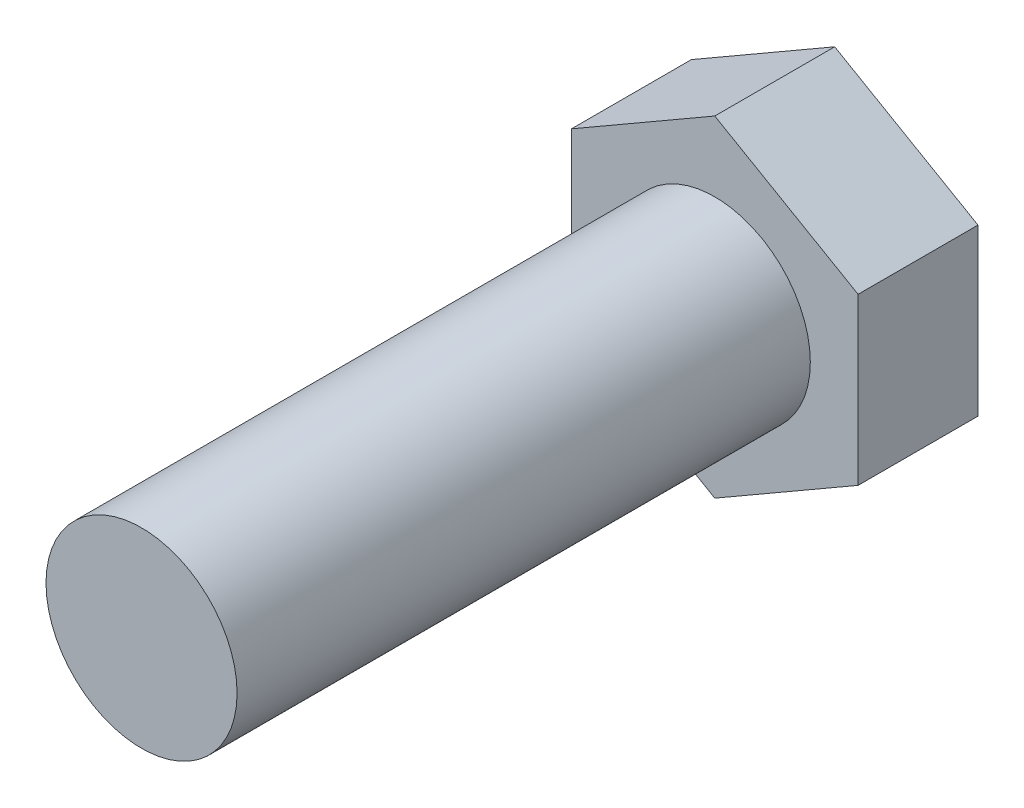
ISO-10303-21;
HEADER;
FILE_DESCRIPTION(('STEP AP214'),'2;1');
FILE_NAME('part.step','',(''),(''),'','','');
FILE_SCHEMA(('AUTOMOTIVE_DESIGN { 1 0 10303 214 1 1 1 1 }'));
ENDSEC;
DATA;
#1=APPLICATION_CONTEXT('core data for automotive mechanical design processes');
#2=APPLICATION_PROTOCOL_DEFINITION('international standard','automotive_design',2000,#1);
#3=PRODUCT_CONTEXT('',#1,'mechanical');
#4=PRODUCT('Part','Part','',(#3));
#5=PRODUCT_RELATED_PRODUCT_CATEGORY('part','',(#4));
#6=PRODUCT_DEFINITION_FORMATION('','',#4);
#7=PRODUCT_DEFINITION_CONTEXT('part definition',#1,'design');
#8=PRODUCT_DEFINITION('design','',#6,#7);
#9=PRODUCT_DEFINITION_SHAPE('','',#8);
#10=(LENGTH_UNIT() NAMED_UNIT(*) SI_UNIT(.MILLI.,.METRE.));
#11=(NAMED_UNIT(*) PLANE_ANGLE_UNIT() SI_UNIT($,.RADIAN.));
#12=(NAMED_UNIT(*) SI_UNIT($,.STERADIAN.) SOLID_ANGLE_UNIT());
#13=UNCERTAINTY_MEASURE_WITH_UNIT(LENGTH_MEASURE(1.E-05),#10,'distance_accuracy_value','');
#14=(GEOMETRIC_REPRESENTATION_CONTEXT(3) GLOBAL_UNCERTAINTY_ASSIGNED_CONTEXT((#13)) GLOBAL_UNIT_ASSIGNED_CONTEXT((#10,
#11,#12)) REPRESENTATION_CONTEXT('',''));
#15=CARTESIAN_POINT('',(0.,0.,0.));
#16=DIRECTION('',(0.,0.,1.));
#17=DIRECTION('',(1.,0.,0.));
#18=AXIS2_PLACEMENT_3D('',#15,#16,#17);
#19=CARTESIAN_POINT('',(0.,0.,73.7));
#20=DIRECTION('',(0.,0.,-1.));
#21=DIRECTION('',(-1.,0.,0.));
#22=AXIS2_PLACEMENT_3D('',#19,#20,#21);
#23=PLANE('',#22);
#24=CARTESIAN_POINT('',(0.,0.,73.7));
#25=DIRECTION('',(0.,0.,-1.));
#26=DIRECTION('',(-1.,0.,0.));
#27=AXIS2_PLACEMENT_3D('',#24,#25,#26);
#28=CIRCLE('',#27,10.);
#29=CARTESIAN_POINT('',(-10.,0.,73.7));
#30=VERTEX_POINT('',#29);
#31=EDGE_CURVE('E22',#30,#30,#28,.T.);
#32=ORIENTED_EDGE('',*,*,#31,.F.);
#33=EDGE_LOOP('',(#32));
#34=FACE_BOUND('',#33,.T.);
#35=ADVANCED_FACE('F15',(#34),#23,.F.);
#36=CARTESIAN_POINT('',(0.,0.,3.7));
#37=DIRECTION('',(0.,0.,-1.));
#38=DIRECTION('',(-1.,0.,0.));
#39=AXIS2_PLACEMENT_3D('',#36,#37,#38);
#40=CYLINDRICAL_SURFACE('',#39,10.);
#41=CARTESIAN_POINT('',(0.,0.,13.7));
#42=DIRECTION('',(0.,0.,-1.));
#43=DIRECTION('',(-1.,0.,0.));
#44=AXIS2_PLACEMENT_3D('',#41,#42,#43);
#45=CIRCLE('',#44,10.);
#46=CARTESIAN_POINT('',(-10.,0.,13.7));
#47=VERTEX_POINT('',#46);
#48=EDGE_CURVE('E110',#47,#47,#45,.T.);
#49=ORIENTED_EDGE('',*,*,#48,.F.);
#50=EDGE_LOOP('',(#49));
#51=FACE_BOUND('',#50,.T.);
#52=ORIENTED_EDGE('',*,*,#31,.T.);
#53=EDGE_LOOP('',(#52));
#54=FACE_BOUND('',#53,.T.);
#55=ADVANCED_FACE('F154',(#51,#54),#40,.T.);
#56=CARTESIAN_POINT('',(-10.,0.,13.7));
#57=DIRECTION('',(0.,0.,-1.));
#58=DIRECTION('',(-1.,0.,0.));
#59=AXIS2_PLACEMENT_3D('',#56,#57,#58);
#60=PLANE('',#59);
#61=DIRECTION('',(0.866025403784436,-0.5,0.));
#62=VECTOR('',#61,1.);
#63=CARTESIAN_POINT('',(1.14491749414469E-13,17.3205080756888,13.7));
#64=LINE('',#63,#62);
#65=CARTESIAN_POINT('',(0.,17.3205080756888,13.7));
#66=VERTEX_POINT('',#65);
#67=CARTESIAN_POINT('',(15.,8.66025403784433,13.7));
#68=VERTEX_POINT('',#67);
#69=EDGE_CURVE('E81',#66,#68,#64,.T.);
#70=ORIENTED_EDGE('',*,*,#69,.F.);
#71=DIRECTION('',(-0.866025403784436,-0.5,0.));
#72=VECTOR('',#71,1.);
#73=CARTESIAN_POINT('',(-15.,8.66025403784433,13.7));
#74=LINE('',#73,#72);
#75=CARTESIAN_POINT('',(-15.,8.66025403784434,13.7));
#76=VERTEX_POINT('',#75);
#77=EDGE_CURVE('E107',#66,#76,#74,.T.);
#78=ORIENTED_EDGE('',*,*,#77,.T.);
#79=DIRECTION('',(0.,-1.,0.));
#80=VECTOR('',#79,1.);
#81=CARTESIAN_POINT('',(-15.,0.,13.7));
#82=LINE('',#81,#80);
#83=CARTESIAN_POINT('',(-15.,-8.66025403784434,13.7));
#84=VERTEX_POINT('',#83);
#85=EDGE_CURVE('E104',#76,#84,#82,.T.);
#86=ORIENTED_EDGE('',*,*,#85,.T.);
#87=DIRECTION('',(-0.866025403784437,0.5,0.));
#88=VECTOR('',#87,1.);
#89=CARTESIAN_POINT('',(-15.,-8.66025403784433,13.7));
#90=LINE('',#89,#88);
#91=CARTESIAN_POINT('',(0.,-17.3205080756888,13.7));
#92=VERTEX_POINT('',#91);
#93=EDGE_CURVE('E102',#92,#84,#90,.T.);
#94=ORIENTED_EDGE('',*,*,#93,.F.);
#95=DIRECTION('',(0.866025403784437,0.5,0.));
#96=VECTOR('',#95,1.);
#97=CARTESIAN_POINT('',(0.,-17.3205080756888,13.7));
#98=LINE('',#97,#96);
#99=CARTESIAN_POINT('',(15.,-8.66025403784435,13.7));
#100=VERTEX_POINT('',#99);
#101=EDGE_CURVE('E99',#92,#100,#98,.T.);
#102=ORIENTED_EDGE('',*,*,#101,.T.);
#103=DIRECTION('',(0.,-1.,0.));
#104=VECTOR('',#103,1.);
#105=CARTESIAN_POINT('',(15.,0.,13.7));
#106=LINE('',#105,#104);
#107=EDGE_CURVE('E97',#68,#100,#106,.T.);
#108=ORIENTED_EDGE('',*,*,#107,.F.);
#109=EDGE_LOOP('',(#70,#78,#86,#94,#102,#108));
#110=FACE_BOUND('',#109,.T.);
#111=ORIENTED_EDGE('',*,*,#48,.T.);
#112=EDGE_LOOP('',(#111));
#113=FACE_BOUND('',#112,.T.);
#114=ADVANCED_FACE('F136',(#110,#113),#60,.F.);
#115=CARTESIAN_POINT('',(0.,17.3205080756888,15.));
#116=DIRECTION('',(0.5,-0.866025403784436,0.));
#117=DIRECTION('',(-0.866025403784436,-0.5,0.));
#118=AXIS2_PLACEMENT_3D('',#115,#116,#117);
#119=PLANE('',#118);
#120=DIRECTION('',(0.,0.,-1.));
#121=VECTOR('',#120,1.);
#122=CARTESIAN_POINT('',(0.,17.3205080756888,15.));
#123=LINE('',#122,#121);
#124=CARTESIAN_POINT('',(0.,17.3205080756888,1.15));
#125=VERTEX_POINT('',#124);
#126=EDGE_CURVE('E35',#66,#125,#123,.T.);
#127=ORIENTED_EDGE('',*,*,#126,.T.);
#128=DIRECTION('',(-0.866025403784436,-0.5,0.));
#129=VECTOR('',#128,1.);
#130=CARTESIAN_POINT('',(0.,17.3205080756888,1.15));
#131=LINE('',#130,#129);
#132=CARTESIAN_POINT('',(-15.,8.66025403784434,1.15));
#133=VERTEX_POINT('',#132);
#134=EDGE_CURVE('E28',#125,#133,#131,.T.);
#135=ORIENTED_EDGE('',*,*,#134,.T.);
#136=DIRECTION('',(0.,0.,-1.));
#137=VECTOR('',#136,1.);
#138=CARTESIAN_POINT('',(-15.,8.66025403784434,15.));
#139=LINE('',#138,#137);
#140=EDGE_CURVE('E93',#76,#133,#139,.T.);
#141=ORIENTED_EDGE('',*,*,#140,.F.);
#142=ORIENTED_EDGE('',*,*,#77,.F.);
#143=EDGE_LOOP('',(#127,#135,#141,#142));
#144=FACE_BOUND('',#143,.T.);
#145=ADVANCED_FACE('F130',(#144),#119,.F.);
#146=CARTESIAN_POINT('',(-15.,8.66025403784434,15.));
#147=DIRECTION('',(1.,0.,0.));
#148=DIRECTION('',(0.,-1.,0.));
#149=AXIS2_PLACEMENT_3D('',#146,#147,#148);
#150=PLANE('',#149);
#151=ORIENTED_EDGE('',*,*,#140,.T.);
#152=DIRECTION('',(0.,-1.,0.));
#153=VECTOR('',#152,1.);
#154=CARTESIAN_POINT('',(-15.,8.66025403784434,1.15));
#155=LINE('',#154,#153);
#156=CARTESIAN_POINT('',(-15.,-8.66025403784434,1.15));
#157=VERTEX_POINT('',#156);
#158=EDGE_CURVE('E126',#133,#157,#155,.T.);
#159=ORIENTED_EDGE('',*,*,#158,.T.);
#160=DIRECTION('',(0.,0.,-1.));
#161=VECTOR('',#160,1.);
#162=CARTESIAN_POINT('',(-15.,-8.66025403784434,15.));
#163=LINE('',#162,#161);
#164=EDGE_CURVE('E90',#84,#157,#163,.T.);
#165=ORIENTED_EDGE('',*,*,#164,.F.);
#166=ORIENTED_EDGE('',*,*,#85,.F.);
#167=EDGE_LOOP('',(#151,#159,#165,#166));
#168=FACE_BOUND('',#167,.T.);
#169=ADVANCED_FACE('F132',(#168),#150,.F.);
#170=CARTESIAN_POINT('',(0.,-17.3205080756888,15.));
#171=DIRECTION('',(-0.5,-0.866025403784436,0.));
#172=DIRECTION('',(-0.866025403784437,0.5,0.));
#173=AXIS2_PLACEMENT_3D('',#170,#171,#172);
#174=PLANE('',#173);
#175=DIRECTION('',(-0.866025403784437,0.5,0.));
#176=VECTOR('',#175,1.);
#177=CARTESIAN_POINT('',(0.,-17.3205080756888,1.15));
#178=LINE('',#177,#176);
#179=CARTESIAN_POINT('',(0.,-17.3205080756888,1.15));
#180=VERTEX_POINT('',#179);
#181=EDGE_CURVE('E124',#180,#157,#178,.T.);
#182=ORIENTED_EDGE('',*,*,#181,.F.);
#183=DIRECTION('',(0.,0.,-1.));
#184=VECTOR('',#183,1.);
#185=CARTESIAN_POINT('',(0.,-17.3205080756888,15.));
#186=LINE('',#185,#184);
#187=EDGE_CURVE('E83',#92,#180,#186,.T.);
#188=ORIENTED_EDGE('',*,*,#187,.F.);
#189=ORIENTED_EDGE('',*,*,#93,.T.);
#190=ORIENTED_EDGE('',*,*,#164,.T.);
#191=EDGE_LOOP('',(#182,#188,#189,#190));
#192=FACE_BOUND('',#191,.T.);
#193=ADVANCED_FACE('F143',(#192),#174,.T.);
#194=CARTESIAN_POINT('',(0.,-17.3205080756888,15.));
#195=DIRECTION('',(-0.5,0.866025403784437,0.));
#196=DIRECTION('',(0.866025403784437,0.5,0.));
#197=AXIS2_PLACEMENT_3D('',#194,#195,#196);
#198=PLANE('',#197);
#199=ORIENTED_EDGE('',*,*,#187,.T.);
#200=DIRECTION('',(0.866025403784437,0.5,0.));
#201=VECTOR('',#200,1.);
#202=CARTESIAN_POINT('',(0.,-17.3205080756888,1.15));
#203=LINE('',#202,#201);
#204=CARTESIAN_POINT('',(15.,-8.66025403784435,1.15));
#205=VERTEX_POINT('',#204);
#206=EDGE_CURVE('E76',#180,#205,#203,.T.);
#207=ORIENTED_EDGE('',*,*,#206,.T.);
#208=DIRECTION('',(0.,0.,-1.));
#209=VECTOR('',#208,1.);
#210=CARTESIAN_POINT('',(15.,-8.66025403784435,15.));
#211=LINE('',#210,#209);
#212=EDGE_CURVE('E75',#100,#205,#211,.T.);
#213=ORIENTED_EDGE('',*,*,#212,.F.);
#214=ORIENTED_EDGE('',*,*,#101,.F.);
#215=EDGE_LOOP('',(#199,#207,#213,#214));
#216=FACE_BOUND('',#215,.T.);
#217=ADVANCED_FACE('F139',(#216),#198,.F.);
#218=CARTESIAN_POINT('',(15.,8.66025403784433,15.));
#219=DIRECTION('',(1.,0.,0.));
#220=DIRECTION('',(0.,-1.,0.));
#221=AXIS2_PLACEMENT_3D('',#218,#219,#220);
#222=PLANE('',#221);
#223=DIRECTION('',(0.,-1.,0.));
#224=VECTOR('',#223,1.);
#225=CARTESIAN_POINT('',(15.,8.66025403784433,1.15));
#226=LINE('',#225,#224);
#227=CARTESIAN_POINT('',(15.,8.66025403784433,1.15));
#228=VERTEX_POINT('',#227);
#229=EDGE_CURVE('E65',#228,#205,#226,.T.);
#230=ORIENTED_EDGE('',*,*,#229,.F.);
#231=DIRECTION('',(0.,0.,-1.));
#232=VECTOR('',#231,1.);
#233=CARTESIAN_POINT('',(15.,8.66025403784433,15.));
#234=LINE('',#233,#232);
#235=EDGE_CURVE('E72',#68,#228,#234,.T.);
#236=ORIENTED_EDGE('',*,*,#235,.F.);
#237=ORIENTED_EDGE('',*,*,#107,.T.);
#238=ORIENTED_EDGE('',*,*,#212,.T.);
#239=EDGE_LOOP('',(#230,#236,#237,#238));
#240=FACE_BOUND('',#239,.T.);
#241=ADVANCED_FACE('F71',(#240),#222,.T.);
#242=CARTESIAN_POINT('',(0.,17.3205080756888,15.));
#243=DIRECTION('',(0.5,0.866025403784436,0.));
#244=DIRECTION('',(0.866025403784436,-0.5,0.));
#245=AXIS2_PLACEMENT_3D('',#242,#243,#244);
#246=PLANE('',#245);
#247=DIRECTION('',(0.866025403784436,-0.5,0.));
#248=VECTOR('',#247,1.);
#249=CARTESIAN_POINT('',(0.,17.3205080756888,1.15));
#250=LINE('',#249,#248);
#251=EDGE_CURVE('E9',#125,#228,#250,.T.);
#252=ORIENTED_EDGE('',*,*,#251,.F.);
#253=ORIENTED_EDGE('',*,*,#126,.F.);
#254=ORIENTED_EDGE('',*,*,#69,.T.);
#255=ORIENTED_EDGE('',*,*,#235,.T.);
#256=EDGE_LOOP('',(#252,#253,#254,#255));
#257=FACE_BOUND('',#256,.T.);
#258=ADVANCED_FACE('F79',(#257),#246,.T.);
#259=CARTESIAN_POINT('',(0.,19.25,1.15));
#260=DIRECTION('',(0.,0.,1.));
#261=DIRECTION('',(1.,0.,0.));
#262=AXIS2_PLACEMENT_3D('',#259,#260,#261);
#263=PLANE('',#262);
#264=CARTESIAN_POINT('',(0.,0.,1.15));
#265=DIRECTION('',(0.,0.,-1.));
#266=DIRECTION('',(-1.,0.,0.));
#267=AXIS2_PLACEMENT_3D('',#264,#265,#266);
#268=CIRCLE('',#267,12.7);
#269=CARTESIAN_POINT('',(-12.7,0.,1.15));
#270=VERTEX_POINT('',#269);
#271=EDGE_CURVE('E115',#270,#270,#268,.T.);
#272=ORIENTED_EDGE('',*,*,#271,.F.);
#273=EDGE_LOOP('',(#272));
#274=FACE_BOUND('',#273,.T.);
#275=ORIENTED_EDGE('',*,*,#251,.T.);
#276=ORIENTED_EDGE('',*,*,#229,.T.);
#277=ORIENTED_EDGE('',*,*,#206,.F.);
#278=ORIENTED_EDGE('',*,*,#181,.T.);
#279=ORIENTED_EDGE('',*,*,#158,.F.);
#280=ORIENTED_EDGE('',*,*,#134,.F.);
#281=EDGE_LOOP('',(#275,#276,#277,#278,#279,#280));
#282=FACE_BOUND('',#281,.T.);
#283=ADVANCED_FACE('F64',(#274,#282),#263,.F.);
#284=CARTESIAN_POINT('',(0.,0.,33.7));
#285=DIRECTION('',(0.,0.,-1.));
#286=DIRECTION('',(-1.,0.,0.));
#287=AXIS2_PLACEMENT_3D('',#284,#285,#286);
#288=CYLINDRICAL_SURFACE('',#287,12.7);
#289=ORIENTED_EDGE('',*,*,#271,.T.);
#290=EDGE_LOOP('',(#289));
#291=FACE_BOUND('',#290,.T.);
#292=CARTESIAN_POINT('',(0.,0.,0.));
#293=DIRECTION('',(0.,0.,1.));
#294=DIRECTION('',(1.,0.,0.));
#295=AXIS2_PLACEMENT_3D('',#292,#293,#294);
#296=CIRCLE('',#295,12.7);
#297=CARTESIAN_POINT('',(12.7,0.,0.));
#298=VERTEX_POINT('',#297);
#299=EDGE_CURVE('E77',#298,#298,#296,.T.);
#300=ORIENTED_EDGE('',*,*,#299,.T.);
#301=EDGE_LOOP('',(#300));
#302=FACE_BOUND('',#301,.T.);
#303=ADVANCED_FACE('F170',(#291,#302),#288,.T.);
#304=CARTESIAN_POINT('',(-17.5,0.,0.));
#305=DIRECTION('',(0.,0.,1.));
#306=DIRECTION('',(1.,0.,0.));
#307=AXIS2_PLACEMENT_3D('',#304,#305,#306);
#308=PLANE('',#307);
#309=ORIENTED_EDGE('',*,*,#299,.F.);
#310=EDGE_LOOP('',(#309));
#311=FACE_BOUND('',#310,.T.);
#312=ADVANCED_FACE('F168',(#311),#308,.F.);
#313=CLOSED_SHELL('',(#35,#55,#114,#145,#169,#193,#217,#241,#258,#283,#303,#312));
#314=MANIFOLD_SOLID_BREP('B1',#313);
#315=ADVANCED_BREP_SHAPE_REPRESENTATION('',(#18,#314),#14);
#316=SHAPE_DEFINITION_REPRESENTATION(#9,#315);
ENDSEC;
END-ISO-10303-21;
